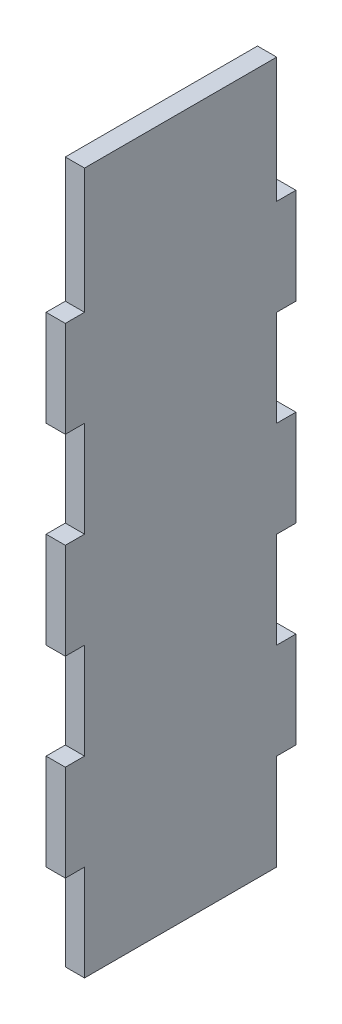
from build123d import *

# Parameters (mm, degrees)
SKETCH1_W           = 2
SKETCH1_H           = 73
BOSS_EXTRUDE1_DEPTH = 20
SKETCH3_W           = 2
SKETCH3_H           = 10
BOSS_EXTRUDE2_DEPTH = 2
LPATTERN1_COUNT     = 3
LPATTERN1_PITCH     = 20
SKETCH4_W           = 2
SKETCH4_H           = 10
BOSS_EXTRUDE3_DEPTH = 2


with BuildPart() as part:
    # Sketch1 → Boss-Extrude1 (new body)
    with BuildSketch(Plane.XY):
        with Locations((-29, 32.5)):
            Rectangle(SKETCH1_W, SKETCH1_H)
    extrude(amount=BOSS_EXTRUDE1_DEPTH)

    # Sketch3 → Boss-Extrude2 (add)
    with BuildSketch(Plane(origin=(0, 0, 0), x_dir=(-1, 0, 0), z_dir=(0, 0, -1))):
        with Locations((29, 11)):
            Rectangle(SKETCH3_W, SKETCH3_H)
    boss_extrude2 = extrude(amount=BOSS_EXTRUDE2_DEPTH)

    # LPattern1: Boss-Extrude2 ×3
    with Locations(*[(0, i * LPATTERN1_PITCH, 0) for i in range(1, LPATTERN1_COUNT)]):
        add(boss_extrude2)

    # Sketch4 → Boss-Extrude3 (add)
    with BuildSketch(Plane.XY.offset(20)):
        with Locations((-29, 51)):
            Rectangle(SKETCH4_W, SKETCH4_H)
        with Locations((-29, 31)):
            Rectangle(SKETCH4_W, SKETCH4_H)
        with Locations((-29, 11)):
            Rectangle(SKETCH4_W, SKETCH4_H)
    extrude(amount=BOSS_EXTRUDE3_DEPTH)


solid = part.part
